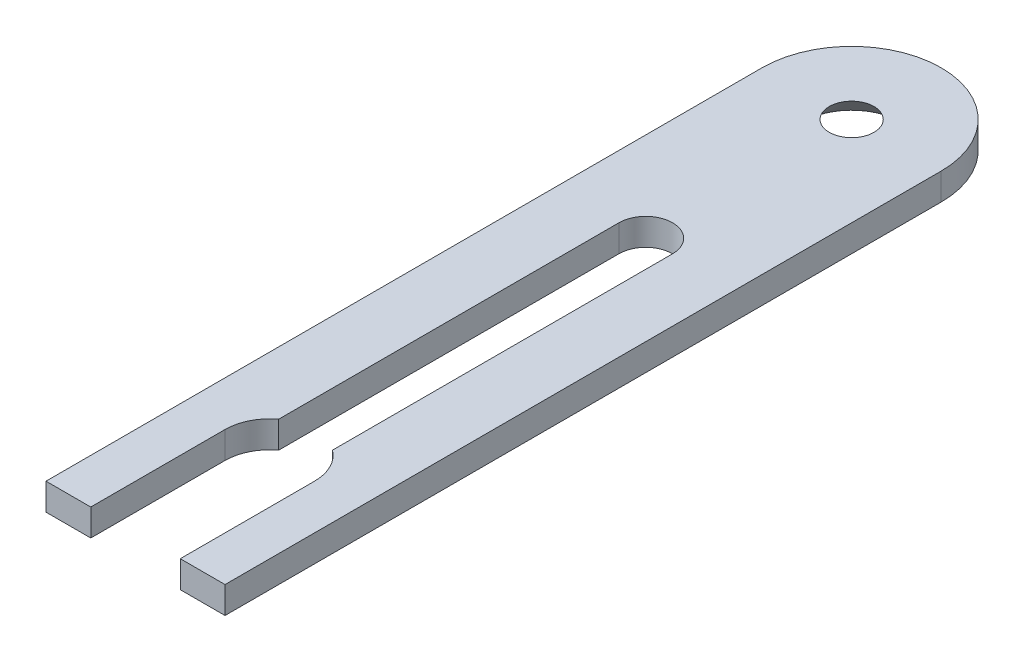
ISO-10303-21;
HEADER;
FILE_DESCRIPTION(('STEP AP214'),'2;1');
FILE_NAME('part.step','',(''),(''),'','','');
FILE_SCHEMA(('AUTOMOTIVE_DESIGN { 1 0 10303 214 1 1 1 1 }'));
ENDSEC;
DATA;
#1=APPLICATION_CONTEXT('core data for automotive mechanical design processes');
#2=APPLICATION_PROTOCOL_DEFINITION('international standard','automotive_design',2000,#1);
#3=PRODUCT_CONTEXT('',#1,'mechanical');
#4=PRODUCT('Part','Part','',(#3));
#5=PRODUCT_RELATED_PRODUCT_CATEGORY('part','',(#4));
#6=PRODUCT_DEFINITION_FORMATION('','',#4);
#7=PRODUCT_DEFINITION_CONTEXT('part definition',#1,'design');
#8=PRODUCT_DEFINITION('design','',#6,#7);
#9=PRODUCT_DEFINITION_SHAPE('','',#8);
#10=(LENGTH_UNIT() NAMED_UNIT(*) SI_UNIT(.MILLI.,.METRE.));
#11=(NAMED_UNIT(*) PLANE_ANGLE_UNIT() SI_UNIT($,.RADIAN.));
#12=(NAMED_UNIT(*) SI_UNIT($,.STERADIAN.) SOLID_ANGLE_UNIT());
#13=UNCERTAINTY_MEASURE_WITH_UNIT(LENGTH_MEASURE(1.E-05),#10,'distance_accuracy_value','');
#14=(GEOMETRIC_REPRESENTATION_CONTEXT(3) GLOBAL_UNCERTAINTY_ASSIGNED_CONTEXT((#13)) GLOBAL_UNIT_ASSIGNED_CONTEXT((#10,
#11,#12)) REPRESENTATION_CONTEXT('',''));
#15=CARTESIAN_POINT('',(0.,0.,0.));
#16=DIRECTION('',(0.,0.,1.));
#17=DIRECTION('',(1.,0.,0.));
#18=AXIS2_PLACEMENT_3D('',#15,#16,#17);
#19=CARTESIAN_POINT('',(10.,3.,-80.));
#20=DIRECTION('',(0.,1.,0.));
#21=DIRECTION('',(0.,0.,1.));
#22=AXIS2_PLACEMENT_3D('',#19,#20,#21);
#23=PLANE('',#22);
#24=DIRECTION('',(0.,0.,1.));
#25=VECTOR('',#24,1.);
#26=CARTESIAN_POINT('',(0.,3.,0.));
#27=LINE('',#26,#25);
#28=CARTESIAN_POINT('',(0.,3.,-80.));
#29=VERTEX_POINT('',#28);
#30=CARTESIAN_POINT('',(0.,3.,0.));
#31=VERTEX_POINT('',#30);
#32=EDGE_CURVE('E164',#29,#31,#27,.T.);
#33=ORIENTED_EDGE('',*,*,#32,.T.);
#34=DIRECTION('',(1.,0.,0.));
#35=VECTOR('',#34,1.);
#36=CARTESIAN_POINT('',(0.,3.,0.));
#37=LINE('',#36,#35);
#38=CARTESIAN_POINT('',(5.,3.,0.));
#39=VERTEX_POINT('',#38);
#40=EDGE_CURVE('E134',#31,#39,#37,.T.);
#41=ORIENTED_EDGE('',*,*,#40,.T.);
#42=DIRECTION('',(0.,0.,-1.));
#43=VECTOR('',#42,1.);
#44=CARTESIAN_POINT('',(5.,3.,-15.));
#45=LINE('',#44,#43);
#46=CARTESIAN_POINT('',(5.,3.,-15.));
#47=VERTEX_POINT('',#46);
#48=EDGE_CURVE('E167',#39,#47,#45,.T.);
#49=ORIENTED_EDGE('',*,*,#48,.T.);
#50=CARTESIAN_POINT('',(10.,3.,-15.));
#51=DIRECTION('',(0.,-1.,0.));
#52=DIRECTION('',(0.,0.,1.));
#53=AXIS2_PLACEMENT_3D('',#50,#51,#52);
#54=CIRCLE('',#53,5.);
#55=CARTESIAN_POINT('',(7.,3.,-19.));
#56=VERTEX_POINT('',#55);
#57=EDGE_CURVE('E169',#47,#56,#54,.T.);
#58=ORIENTED_EDGE('',*,*,#57,.T.);
#59=DIRECTION('',(0.,0.,-1.));
#60=VECTOR('',#59,1.);
#61=CARTESIAN_POINT('',(7.,3.,-57.));
#62=LINE('',#61,#60);
#63=CARTESIAN_POINT('',(7.,3.,-57.));
#64=VERTEX_POINT('',#63);
#65=EDGE_CURVE('E171',#56,#64,#62,.T.);
#66=ORIENTED_EDGE('',*,*,#65,.T.);
#67=CARTESIAN_POINT('',(10.,3.,-57.));
#68=DIRECTION('',(0.,-1.,0.));
#69=DIRECTION('',(0.,0.,1.));
#70=AXIS2_PLACEMENT_3D('',#67,#68,#69);
#71=CIRCLE('',#70,3.);
#72=CARTESIAN_POINT('',(13.,3.,-57.));
#73=VERTEX_POINT('',#72);
#74=EDGE_CURVE('E173',#64,#73,#71,.T.);
#75=ORIENTED_EDGE('',*,*,#74,.T.);
#76=DIRECTION('',(0.,0.,1.));
#77=VECTOR('',#76,1.);
#78=CARTESIAN_POINT('',(13.,3.,-57.));
#79=LINE('',#78,#77);
#80=CARTESIAN_POINT('',(13.,3.,-19.));
#81=VERTEX_POINT('',#80);
#82=EDGE_CURVE('E175',#73,#81,#79,.T.);
#83=ORIENTED_EDGE('',*,*,#82,.T.);
#84=CARTESIAN_POINT('',(10.,3.,-15.));
#85=DIRECTION('',(0.,-1.,0.));
#86=DIRECTION('',(0.,0.,1.));
#87=AXIS2_PLACEMENT_3D('',#84,#85,#86);
#88=CIRCLE('',#87,5.);
#89=CARTESIAN_POINT('',(15.,3.,-15.));
#90=VERTEX_POINT('',#89);
#91=EDGE_CURVE('E177',#81,#90,#88,.T.);
#92=ORIENTED_EDGE('',*,*,#91,.T.);
#93=DIRECTION('',(0.,0.,1.));
#94=VECTOR('',#93,1.);
#95=CARTESIAN_POINT('',(15.,3.,-15.));
#96=LINE('',#95,#94);
#97=CARTESIAN_POINT('',(15.,3.,0.));
#98=VERTEX_POINT('',#97);
#99=EDGE_CURVE('E179',#90,#98,#96,.T.);
#100=ORIENTED_EDGE('',*,*,#99,.T.);
#101=DIRECTION('',(1.,0.,0.));
#102=VECTOR('',#101,1.);
#103=CARTESIAN_POINT('',(15.,3.,0.));
#104=LINE('',#103,#102);
#105=CARTESIAN_POINT('',(20.,3.,0.));
#106=VERTEX_POINT('',#105);
#107=EDGE_CURVE('E181',#98,#106,#104,.T.);
#108=ORIENTED_EDGE('',*,*,#107,.T.);
#109=DIRECTION('',(0.,0.,-1.));
#110=VECTOR('',#109,1.);
#111=CARTESIAN_POINT('',(20.,3.,0.));
#112=LINE('',#111,#110);
#113=CARTESIAN_POINT('',(20.,3.,-80.));
#114=VERTEX_POINT('',#113);
#115=EDGE_CURVE('E51',#106,#114,#112,.T.);
#116=ORIENTED_EDGE('',*,*,#115,.T.);
#117=CARTESIAN_POINT('',(10.,3.,-80.));
#118=DIRECTION('',(0.,1.,0.));
#119=DIRECTION('',(0.,0.,1.));
#120=AXIS2_PLACEMENT_3D('',#117,#118,#119);
#121=CIRCLE('',#120,10.);
#122=EDGE_CURVE('E46',#114,#29,#121,.T.);
#123=ORIENTED_EDGE('',*,*,#122,.T.);
#124=EDGE_LOOP('',(#33,#41,#49,#58,#66,#75,#83,#92,#100,#108,#116,#123));
#125=FACE_BOUND('',#124,.T.);
#126=CARTESIAN_POINT('',(10.,3.,-80.));
#127=DIRECTION('',(0.,1.,0.));
#128=DIRECTION('',(0.,0.,1.));
#129=AXIS2_PLACEMENT_3D('',#126,#127,#128);
#130=CIRCLE('',#129,2.5);
#131=CARTESIAN_POINT('',(10.,3.,-77.5));
#132=VERTEX_POINT('',#131);
#133=EDGE_CURVE('E140',#132,#132,#130,.T.);
#134=ORIENTED_EDGE('',*,*,#133,.F.);
#135=EDGE_LOOP('',(#134));
#136=FACE_BOUND('',#135,.T.);
#137=ADVANCED_FACE('F30',(#125,#136),#23,.T.);
#138=CARTESIAN_POINT('',(10.,0.,-80.));
#139=DIRECTION('',(0.,1.,0.));
#140=DIRECTION('',(0.,0.,1.));
#141=AXIS2_PLACEMENT_3D('',#138,#139,#140);
#142=PLANE('',#141);
#143=DIRECTION('',(0.,0.,1.));
#144=VECTOR('',#143,1.);
#145=CARTESIAN_POINT('',(0.,0.,0.));
#146=LINE('',#145,#144);
#147=CARTESIAN_POINT('',(0.,0.,-80.));
#148=VERTEX_POINT('',#147);
#149=CARTESIAN_POINT('',(0.,0.,0.));
#150=VERTEX_POINT('',#149);
#151=EDGE_CURVE('E125',#148,#150,#146,.T.);
#152=ORIENTED_EDGE('',*,*,#151,.F.);
#153=CARTESIAN_POINT('',(10.,0.,-80.));
#154=DIRECTION('',(0.,1.,0.));
#155=DIRECTION('',(0.,0.,1.));
#156=AXIS2_PLACEMENT_3D('',#153,#154,#155);
#157=CIRCLE('',#156,10.);
#158=CARTESIAN_POINT('',(20.,0.,-80.));
#159=VERTEX_POINT('',#158);
#160=EDGE_CURVE('E162',#159,#148,#157,.T.);
#161=ORIENTED_EDGE('',*,*,#160,.F.);
#162=DIRECTION('',(0.,0.,-1.));
#163=VECTOR('',#162,1.);
#164=CARTESIAN_POINT('',(20.,0.,0.));
#165=LINE('',#164,#163);
#166=CARTESIAN_POINT('',(20.,0.,0.));
#167=VERTEX_POINT('',#166);
#168=EDGE_CURVE('E160',#167,#159,#165,.T.);
#169=ORIENTED_EDGE('',*,*,#168,.F.);
#170=DIRECTION('',(1.,0.,0.));
#171=VECTOR('',#170,1.);
#172=CARTESIAN_POINT('',(15.,0.,0.));
#173=LINE('',#172,#171);
#174=CARTESIAN_POINT('',(15.,0.,0.));
#175=VERTEX_POINT('',#174);
#176=EDGE_CURVE('E158',#175,#167,#173,.T.);
#177=ORIENTED_EDGE('',*,*,#176,.F.);
#178=DIRECTION('',(0.,0.,1.));
#179=VECTOR('',#178,1.);
#180=CARTESIAN_POINT('',(15.,0.,-15.));
#181=LINE('',#180,#179);
#182=CARTESIAN_POINT('',(15.,0.,-15.));
#183=VERTEX_POINT('',#182);
#184=EDGE_CURVE('E156',#183,#175,#181,.T.);
#185=ORIENTED_EDGE('',*,*,#184,.F.);
#186=CARTESIAN_POINT('',(10.,0.,-15.));
#187=DIRECTION('',(0.,-1.,0.));
#188=DIRECTION('',(0.,0.,1.));
#189=AXIS2_PLACEMENT_3D('',#186,#187,#188);
#190=CIRCLE('',#189,5.);
#191=CARTESIAN_POINT('',(13.,0.,-19.));
#192=VERTEX_POINT('',#191);
#193=EDGE_CURVE('E154',#192,#183,#190,.T.);
#194=ORIENTED_EDGE('',*,*,#193,.F.);
#195=DIRECTION('',(0.,0.,1.));
#196=VECTOR('',#195,1.);
#197=CARTESIAN_POINT('',(13.,0.,-57.));
#198=LINE('',#197,#196);
#199=CARTESIAN_POINT('',(13.,0.,-57.));
#200=VERTEX_POINT('',#199);
#201=EDGE_CURVE('E152',#200,#192,#198,.T.);
#202=ORIENTED_EDGE('',*,*,#201,.F.);
#203=CARTESIAN_POINT('',(10.,0.,-57.));
#204=DIRECTION('',(0.,-1.,0.));
#205=DIRECTION('',(0.,0.,1.));
#206=AXIS2_PLACEMENT_3D('',#203,#204,#205);
#207=CIRCLE('',#206,3.);
#208=CARTESIAN_POINT('',(7.,0.,-57.));
#209=VERTEX_POINT('',#208);
#210=EDGE_CURVE('E150',#209,#200,#207,.T.);
#211=ORIENTED_EDGE('',*,*,#210,.F.);
#212=DIRECTION('',(0.,0.,-1.));
#213=VECTOR('',#212,1.);
#214=CARTESIAN_POINT('',(7.,0.,-57.));
#215=LINE('',#214,#213);
#216=CARTESIAN_POINT('',(7.,0.,-19.));
#217=VERTEX_POINT('',#216);
#218=EDGE_CURVE('E148',#217,#209,#215,.T.);
#219=ORIENTED_EDGE('',*,*,#218,.F.);
#220=CARTESIAN_POINT('',(10.,0.,-15.));
#221=DIRECTION('',(0.,-1.,0.));
#222=DIRECTION('',(0.,0.,1.));
#223=AXIS2_PLACEMENT_3D('',#220,#221,#222);
#224=CIRCLE('',#223,5.);
#225=CARTESIAN_POINT('',(5.,0.,-15.));
#226=VERTEX_POINT('',#225);
#227=EDGE_CURVE('E146',#226,#217,#224,.T.);
#228=ORIENTED_EDGE('',*,*,#227,.F.);
#229=DIRECTION('',(0.,0.,-1.));
#230=VECTOR('',#229,1.);
#231=CARTESIAN_POINT('',(5.,0.,-15.));
#232=LINE('',#231,#230);
#233=CARTESIAN_POINT('',(5.,0.,0.));
#234=VERTEX_POINT('',#233);
#235=EDGE_CURVE('E127',#234,#226,#232,.T.);
#236=ORIENTED_EDGE('',*,*,#235,.F.);
#237=DIRECTION('',(1.,0.,0.));
#238=VECTOR('',#237,1.);
#239=CARTESIAN_POINT('',(0.,0.,0.));
#240=LINE('',#239,#238);
#241=EDGE_CURVE('E120',#150,#234,#240,.T.);
#242=ORIENTED_EDGE('',*,*,#241,.F.);
#243=EDGE_LOOP('',(#152,#161,#169,#177,#185,#194,#202,#211,#219,#228,#236,#242));
#244=FACE_BOUND('',#243,.T.);
#245=CARTESIAN_POINT('',(10.,0.,-80.));
#246=DIRECTION('',(0.,1.,0.));
#247=DIRECTION('',(0.,0.,1.));
#248=AXIS2_PLACEMENT_3D('',#245,#246,#247);
#249=CIRCLE('',#248,5.50000000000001);
#250=CARTESIAN_POINT('',(10.,0.,-74.5));
#251=VERTEX_POINT('',#250);
#252=EDGE_CURVE('E34',#251,#251,#249,.T.);
#253=ORIENTED_EDGE('',*,*,#252,.T.);
#254=EDGE_LOOP('',(#253));
#255=FACE_BOUND('',#254,.T.);
#256=ADVANCED_FACE('F121',(#244,#255),#142,.F.);
#257=CARTESIAN_POINT('',(0.,3.,0.));
#258=DIRECTION('',(1.,0.,0.));
#259=DIRECTION('',(0.,0.,-1.));
#260=AXIS2_PLACEMENT_3D('',#257,#258,#259);
#261=PLANE('',#260);
#262=ORIENTED_EDGE('',*,*,#151,.T.);
#263=DIRECTION('',(0.,-1.,0.));
#264=VECTOR('',#263,1.);
#265=CARTESIAN_POINT('',(0.,3.,0.));
#266=LINE('',#265,#264);
#267=EDGE_CURVE('E11',#31,#150,#266,.T.);
#268=ORIENTED_EDGE('',*,*,#267,.F.);
#269=ORIENTED_EDGE('',*,*,#32,.F.);
#270=DIRECTION('',(0.,-1.,0.));
#271=VECTOR('',#270,1.);
#272=CARTESIAN_POINT('',(0.,3.,-80.));
#273=LINE('',#272,#271);
#274=EDGE_CURVE('E139',#29,#148,#273,.T.);
#275=ORIENTED_EDGE('',*,*,#274,.T.);
#276=EDGE_LOOP('',(#262,#268,#269,#275));
#277=FACE_BOUND('',#276,.T.);
#278=ADVANCED_FACE('F138',(#277),#261,.F.);
#279=CARTESIAN_POINT('',(0.,3.,0.));
#280=DIRECTION('',(0.,0.,-1.));
#281=DIRECTION('',(-1.,0.,0.));
#282=AXIS2_PLACEMENT_3D('',#279,#280,#281);
#283=PLANE('',#282);
#284=ORIENTED_EDGE('',*,*,#241,.T.);
#285=DIRECTION('',(0.,-1.,0.));
#286=VECTOR('',#285,1.);
#287=CARTESIAN_POINT('',(5.,3.,0.));
#288=LINE('',#287,#286);
#289=EDGE_CURVE('E39',#39,#234,#288,.T.);
#290=ORIENTED_EDGE('',*,*,#289,.F.);
#291=ORIENTED_EDGE('',*,*,#40,.F.);
#292=ORIENTED_EDGE('',*,*,#267,.T.);
#293=EDGE_LOOP('',(#284,#290,#291,#292));
#294=FACE_BOUND('',#293,.T.);
#295=ADVANCED_FACE('F133',(#294),#283,.F.);
#296=CARTESIAN_POINT('',(5.,3.,-15.));
#297=DIRECTION('',(-1.,0.,0.));
#298=DIRECTION('',(0.,0.,1.));
#299=AXIS2_PLACEMENT_3D('',#296,#297,#298);
#300=PLANE('',#299);
#301=ORIENTED_EDGE('',*,*,#235,.T.);
#302=DIRECTION('',(0.,-1.,0.));
#303=VECTOR('',#302,1.);
#304=CARTESIAN_POINT('',(5.,3.,-15.));
#305=LINE('',#304,#303);
#306=EDGE_CURVE('E210',#47,#226,#305,.T.);
#307=ORIENTED_EDGE('',*,*,#306,.F.);
#308=ORIENTED_EDGE('',*,*,#48,.F.);
#309=ORIENTED_EDGE('',*,*,#289,.T.);
#310=EDGE_LOOP('',(#301,#307,#308,#309));
#311=FACE_BOUND('',#310,.T.);
#312=ADVANCED_FACE('F215',(#311),#300,.F.);
#313=CARTESIAN_POINT('',(10.,3.,-15.));
#314=DIRECTION('',(0.,-1.,0.));
#315=DIRECTION('',(0.,0.,-1.));
#316=AXIS2_PLACEMENT_3D('',#313,#314,#315);
#317=CYLINDRICAL_SURFACE('',#316,5.);
#318=ORIENTED_EDGE('',*,*,#227,.T.);
#319=DIRECTION('',(0.,-1.,0.));
#320=VECTOR('',#319,1.);
#321=CARTESIAN_POINT('',(7.,3.,-19.));
#322=LINE('',#321,#320);
#323=EDGE_CURVE('E207',#56,#217,#322,.T.);
#324=ORIENTED_EDGE('',*,*,#323,.F.);
#325=ORIENTED_EDGE('',*,*,#57,.F.);
#326=ORIENTED_EDGE('',*,*,#306,.T.);
#327=EDGE_LOOP('',(#318,#324,#325,#326));
#328=FACE_BOUND('',#327,.T.);
#329=ADVANCED_FACE('F223',(#328),#317,.F.);
#330=CARTESIAN_POINT('',(7.,3.,-57.));
#331=DIRECTION('',(-1.,0.,0.));
#332=DIRECTION('',(0.,0.,1.));
#333=AXIS2_PLACEMENT_3D('',#330,#331,#332);
#334=PLANE('',#333);
#335=ORIENTED_EDGE('',*,*,#218,.T.);
#336=DIRECTION('',(0.,-1.,0.));
#337=VECTOR('',#336,1.);
#338=CARTESIAN_POINT('',(7.,3.,-57.));
#339=LINE('',#338,#337);
#340=EDGE_CURVE('E204',#64,#209,#339,.T.);
#341=ORIENTED_EDGE('',*,*,#340,.F.);
#342=ORIENTED_EDGE('',*,*,#65,.F.);
#343=ORIENTED_EDGE('',*,*,#323,.T.);
#344=EDGE_LOOP('',(#335,#341,#342,#343));
#345=FACE_BOUND('',#344,.T.);
#346=ADVANCED_FACE('F226',(#345),#334,.F.);
#347=CARTESIAN_POINT('',(10.,3.,-57.));
#348=DIRECTION('',(0.,-1.,0.));
#349=DIRECTION('',(0.,0.,-1.));
#350=AXIS2_PLACEMENT_3D('',#347,#348,#349);
#351=CYLINDRICAL_SURFACE('',#350,3.);
#352=ORIENTED_EDGE('',*,*,#210,.T.);
#353=DIRECTION('',(0.,-1.,0.));
#354=VECTOR('',#353,1.);
#355=CARTESIAN_POINT('',(13.,3.,-57.));
#356=LINE('',#355,#354);
#357=EDGE_CURVE('E201',#73,#200,#356,.T.);
#358=ORIENTED_EDGE('',*,*,#357,.F.);
#359=ORIENTED_EDGE('',*,*,#74,.F.);
#360=ORIENTED_EDGE('',*,*,#340,.T.);
#361=EDGE_LOOP('',(#352,#358,#359,#360));
#362=FACE_BOUND('',#361,.T.);
#363=ADVANCED_FACE('F231',(#362),#351,.F.);
#364=CARTESIAN_POINT('',(13.,3.,-57.));
#365=DIRECTION('',(1.,0.,0.));
#366=DIRECTION('',(0.,0.,-1.));
#367=AXIS2_PLACEMENT_3D('',#364,#365,#366);
#368=PLANE('',#367);
#369=ORIENTED_EDGE('',*,*,#201,.T.);
#370=DIRECTION('',(0.,-1.,0.));
#371=VECTOR('',#370,1.);
#372=CARTESIAN_POINT('',(13.,3.,-19.));
#373=LINE('',#372,#371);
#374=EDGE_CURVE('E198',#81,#192,#373,.T.);
#375=ORIENTED_EDGE('',*,*,#374,.F.);
#376=ORIENTED_EDGE('',*,*,#82,.F.);
#377=ORIENTED_EDGE('',*,*,#357,.T.);
#378=EDGE_LOOP('',(#369,#375,#376,#377));
#379=FACE_BOUND('',#378,.T.);
#380=ADVANCED_FACE('F237',(#379),#368,.F.);
#381=CARTESIAN_POINT('',(10.,3.,-15.));
#382=DIRECTION('',(0.,-1.,0.));
#383=DIRECTION('',(0.,0.,-1.));
#384=AXIS2_PLACEMENT_3D('',#381,#382,#383);
#385=CYLINDRICAL_SURFACE('',#384,5.);
#386=ORIENTED_EDGE('',*,*,#193,.T.);
#387=DIRECTION('',(0.,-1.,0.));
#388=VECTOR('',#387,1.);
#389=CARTESIAN_POINT('',(15.,3.,-15.));
#390=LINE('',#389,#388);
#391=EDGE_CURVE('E195',#90,#183,#390,.T.);
#392=ORIENTED_EDGE('',*,*,#391,.F.);
#393=ORIENTED_EDGE('',*,*,#91,.F.);
#394=ORIENTED_EDGE('',*,*,#374,.T.);
#395=EDGE_LOOP('',(#386,#392,#393,#394));
#396=FACE_BOUND('',#395,.T.);
#397=ADVANCED_FACE('F241',(#396),#385,.F.);
#398=CARTESIAN_POINT('',(15.,3.,-15.));
#399=DIRECTION('',(1.,0.,0.));
#400=DIRECTION('',(0.,0.,-1.));
#401=AXIS2_PLACEMENT_3D('',#398,#399,#400);
#402=PLANE('',#401);
#403=ORIENTED_EDGE('',*,*,#184,.T.);
#404=DIRECTION('',(0.,-1.,0.));
#405=VECTOR('',#404,1.);
#406=CARTESIAN_POINT('',(15.,3.,0.));
#407=LINE('',#406,#405);
#408=EDGE_CURVE('E192',#98,#175,#407,.T.);
#409=ORIENTED_EDGE('',*,*,#408,.F.);
#410=ORIENTED_EDGE('',*,*,#99,.F.);
#411=ORIENTED_EDGE('',*,*,#391,.T.);
#412=EDGE_LOOP('',(#403,#409,#410,#411));
#413=FACE_BOUND('',#412,.T.);
#414=ADVANCED_FACE('F246',(#413),#402,.F.);
#415=CARTESIAN_POINT('',(15.,3.,0.));
#416=DIRECTION('',(0.,0.,-1.));
#417=DIRECTION('',(-1.,0.,0.));
#418=AXIS2_PLACEMENT_3D('',#415,#416,#417);
#419=PLANE('',#418);
#420=ORIENTED_EDGE('',*,*,#176,.T.);
#421=DIRECTION('',(0.,-1.,0.));
#422=VECTOR('',#421,1.);
#423=CARTESIAN_POINT('',(20.,3.,0.));
#424=LINE('',#423,#422);
#425=EDGE_CURVE('E189',#106,#167,#424,.T.);
#426=ORIENTED_EDGE('',*,*,#425,.F.);
#427=ORIENTED_EDGE('',*,*,#107,.F.);
#428=ORIENTED_EDGE('',*,*,#408,.T.);
#429=EDGE_LOOP('',(#420,#426,#427,#428));
#430=FACE_BOUND('',#429,.T.);
#431=ADVANCED_FACE('F250',(#430),#419,.F.);
#432=CARTESIAN_POINT('',(20.,3.,0.));
#433=DIRECTION('',(-1.,0.,0.));
#434=DIRECTION('',(0.,0.,1.));
#435=AXIS2_PLACEMENT_3D('',#432,#433,#434);
#436=PLANE('',#435);
#437=ORIENTED_EDGE('',*,*,#168,.T.);
#438=DIRECTION('',(0.,-1.,0.));
#439=VECTOR('',#438,1.);
#440=CARTESIAN_POINT('',(20.,3.,-80.));
#441=LINE('',#440,#439);
#442=EDGE_CURVE('E186',#114,#159,#441,.T.);
#443=ORIENTED_EDGE('',*,*,#442,.F.);
#444=ORIENTED_EDGE('',*,*,#115,.F.);
#445=ORIENTED_EDGE('',*,*,#425,.T.);
#446=EDGE_LOOP('',(#437,#443,#444,#445));
#447=FACE_BOUND('',#446,.T.);
#448=ADVANCED_FACE('F254',(#447),#436,.F.);
#449=CARTESIAN_POINT('',(10.,3.,-80.));
#450=DIRECTION('',(0.,-1.,0.));
#451=DIRECTION('',(0.,0.,-1.));
#452=AXIS2_PLACEMENT_3D('',#449,#450,#451);
#453=CYLINDRICAL_SURFACE('',#452,10.);
#454=ORIENTED_EDGE('',*,*,#160,.T.);
#455=ORIENTED_EDGE('',*,*,#274,.F.);
#456=ORIENTED_EDGE('',*,*,#122,.F.);
#457=ORIENTED_EDGE('',*,*,#442,.T.);
#458=EDGE_LOOP('',(#454,#455,#456,#457));
#459=FACE_BOUND('',#458,.T.);
#460=ADVANCED_FACE('F256',(#459),#453,.T.);
#461=CARTESIAN_POINT('',(10.,3.,-80.));
#462=DIRECTION('',(0.,-1.,0.));
#463=DIRECTION('',(0.,0.,1.));
#464=AXIS2_PLACEMENT_3D('',#461,#462,#463);
#465=CONICAL_SURFACE('',#464,2.5,0.78539816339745);
#466=ORIENTED_EDGE('',*,*,#133,.T.);
#467=EDGE_LOOP('',(#466));
#468=FACE_BOUND('',#467,.T.);
#469=ORIENTED_EDGE('',*,*,#252,.F.);
#470=EDGE_LOOP('',(#469));
#471=FACE_BOUND('',#470,.T.);
#472=ADVANCED_FACE('F32',(#468,#471),#465,.F.);
#473=CLOSED_SHELL('',(#137,#256,#278,#295,#312,#329,#346,#363,#380,#397,#414,#431,#448,#460,#472));
#474=MANIFOLD_SOLID_BREP('B2',#473);
#475=ADVANCED_BREP_SHAPE_REPRESENTATION('',(#18,#474),#14);
#476=SHAPE_DEFINITION_REPRESENTATION(#9,#475);
ENDSEC;
END-ISO-10303-21;
